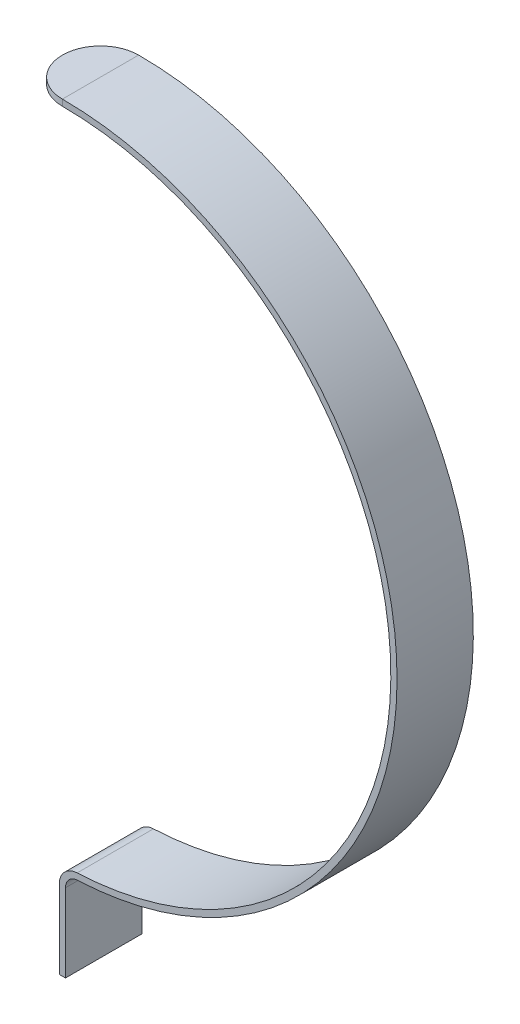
ISO-10303-21;
HEADER;
FILE_DESCRIPTION(('STEP AP214'),'2;1');
FILE_NAME('part.step','',(''),(''),'','','');
FILE_SCHEMA(('AUTOMOTIVE_DESIGN { 1 0 10303 214 1 1 1 1 }'));
ENDSEC;
DATA;
#1=APPLICATION_CONTEXT('core data for automotive mechanical design processes');
#2=APPLICATION_PROTOCOL_DEFINITION('international standard','automotive_design',2000,#1);
#3=PRODUCT_CONTEXT('',#1,'mechanical');
#4=PRODUCT('Part','Part','',(#3));
#5=PRODUCT_RELATED_PRODUCT_CATEGORY('part','',(#4));
#6=PRODUCT_DEFINITION_FORMATION('','',#4);
#7=PRODUCT_DEFINITION_CONTEXT('part definition',#1,'design');
#8=PRODUCT_DEFINITION('design','',#6,#7);
#9=PRODUCT_DEFINITION_SHAPE('','',#8);
#10=(LENGTH_UNIT() NAMED_UNIT(*) SI_UNIT(.MILLI.,.METRE.));
#11=(NAMED_UNIT(*) PLANE_ANGLE_UNIT() SI_UNIT($,.RADIAN.));
#12=(NAMED_UNIT(*) SI_UNIT($,.STERADIAN.) SOLID_ANGLE_UNIT());
#13=UNCERTAINTY_MEASURE_WITH_UNIT(LENGTH_MEASURE(1.E-05),#10,'distance_accuracy_value','');
#14=(GEOMETRIC_REPRESENTATION_CONTEXT(3) GLOBAL_UNCERTAINTY_ASSIGNED_CONTEXT((#13)) GLOBAL_UNIT_ASSIGNED_CONTEXT((#10,
#11,#12)) REPRESENTATION_CONTEXT('',''));
#15=CARTESIAN_POINT('',(0.,0.,0.));
#16=DIRECTION('',(0.,0.,1.));
#17=DIRECTION('',(1.,0.,0.));
#18=AXIS2_PLACEMENT_3D('',#15,#16,#17);
#19=CARTESIAN_POINT('',(0.,27.051,0.));
#20=DIRECTION('',(0.,0.,1.));
#21=DIRECTION('',(1.,0.,0.));
#22=AXIS2_PLACEMENT_3D('',#19,#20,#21);
#23=CYLINDRICAL_SURFACE('',#22,27.305);
#24=DIRECTION('',(0.,0.,1.));
#25=VECTOR('',#24,1.);
#26=CARTESIAN_POINT('',(1.22443946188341,-0.226532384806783,-3.1115));
#27=LINE('',#26,#25);
#28=CARTESIAN_POINT('',(1.22443946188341,-0.226532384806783,-3.1115));
#29=VERTEX_POINT('',#28);
#30=CARTESIAN_POINT('',(1.22443946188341,-0.226532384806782,3.1115));
#31=VERTEX_POINT('',#30);
#32=EDGE_CURVE('E118',#29,#31,#27,.T.);
#33=ORIENTED_EDGE('',*,*,#32,.F.);
#34=CARTESIAN_POINT('',(0.,27.051,-3.1115));
#35=DIRECTION('',(0.,0.,1.));
#36=DIRECTION('',(1.,0.,0.));
#37=AXIS2_PLACEMENT_3D('',#34,#35,#36);
#38=CIRCLE('',#37,27.305);
#39=CARTESIAN_POINT('',(0.,54.356,-3.1115));
#40=VERTEX_POINT('',#39);
#41=EDGE_CURVE('E136',#29,#40,#38,.T.);
#42=ORIENTED_EDGE('',*,*,#41,.T.);
#43=DIRECTION('',(0.,0.,1.));
#44=VECTOR('',#43,1.);
#45=CARTESIAN_POINT('',(0.,54.356,-3.1115));
#46=LINE('',#45,#44);
#47=CARTESIAN_POINT('',(0.,54.356,3.1115));
#48=VERTEX_POINT('',#47);
#49=EDGE_CURVE('E111',#40,#48,#46,.T.);
#50=ORIENTED_EDGE('',*,*,#49,.T.);
#51=CARTESIAN_POINT('',(0.,27.051,3.1115));
#52=DIRECTION('',(0.,0.,1.));
#53=DIRECTION('',(1.,0.,0.));
#54=AXIS2_PLACEMENT_3D('',#51,#52,#53);
#55=CIRCLE('',#54,27.305);
#56=EDGE_CURVE('E37',#31,#48,#55,.T.);
#57=ORIENTED_EDGE('',*,*,#56,.F.);
#58=EDGE_LOOP('',(#33,#42,#50,#57));
#59=FACE_BOUND('',#58,.T.);
#60=ADVANCED_FACE('F29',(#59),#23,.T.);
#61=CARTESIAN_POINT('',(0.,27.051,0.));
#62=DIRECTION('',(0.,0.,1.));
#63=DIRECTION('',(1.,0.,0.));
#64=AXIS2_PLACEMENT_3D('',#61,#62,#63);
#65=CYLINDRICAL_SURFACE('',#64,26.797);
#66=DIRECTION('',(0.,0.,-1.));
#67=VECTOR('',#66,1.);
#68=CARTESIAN_POINT('',(1.20165919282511,0.280956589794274,3.1115));
#69=LINE('',#68,#67);
#70=CARTESIAN_POINT('',(1.20165919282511,0.280956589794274,3.1115));
#71=VERTEX_POINT('',#70);
#72=CARTESIAN_POINT('',(1.20165919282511,0.280956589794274,-3.1115));
#73=VERTEX_POINT('',#72);
#74=EDGE_CURVE('E114',#71,#73,#69,.T.);
#75=ORIENTED_EDGE('',*,*,#74,.F.);
#76=CARTESIAN_POINT('',(0.,27.051,3.1115));
#77=DIRECTION('',(0.,0.,1.));
#78=DIRECTION('',(1.,0.,0.));
#79=AXIS2_PLACEMENT_3D('',#76,#77,#78);
#80=CIRCLE('',#79,26.797);
#81=CARTESIAN_POINT('',(0.,53.848,3.1115));
#82=VERTEX_POINT('',#81);
#83=EDGE_CURVE('E11',#71,#82,#80,.T.);
#84=ORIENTED_EDGE('',*,*,#83,.T.);
#85=DIRECTION('',(0.,0.,-1.));
#86=VECTOR('',#85,1.);
#87=CARTESIAN_POINT('',(0.,53.848,3.1115));
#88=LINE('',#87,#86);
#89=CARTESIAN_POINT('',(0.,53.848,-3.1115));
#90=VERTEX_POINT('',#89);
#91=EDGE_CURVE('E92',#82,#90,#88,.T.);
#92=ORIENTED_EDGE('',*,*,#91,.T.);
#93=CARTESIAN_POINT('',(0.,27.051,-3.1115));
#94=DIRECTION('',(0.,0.,1.));
#95=DIRECTION('',(1.,0.,0.));
#96=AXIS2_PLACEMENT_3D('',#93,#94,#95);
#97=CIRCLE('',#96,26.797);
#98=EDGE_CURVE('E110',#73,#90,#97,.T.);
#99=ORIENTED_EDGE('',*,*,#98,.F.);
#100=EDGE_LOOP('',(#75,#84,#92,#99));
#101=FACE_BOUND('',#100,.T.);
#102=ADVANCED_FACE('F112',(#101),#65,.F.);
#103=CARTESIAN_POINT('',(1.27,-1.24151033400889,0.));
#104=DIRECTION('',(0.,0.,-1.));
#105=DIRECTION('',(-1.,0.,0.));
#106=AXIS2_PLACEMENT_3D('',#103,#104,#105);
#107=CYLINDRICAL_SURFACE('',#106,1.016);
#108=DIRECTION('',(0.,0.,1.));
#109=VECTOR('',#108,1.);
#110=CARTESIAN_POINT('',(0.254000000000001,-1.24151033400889,-3.1115));
#111=LINE('',#110,#109);
#112=CARTESIAN_POINT('',(0.254000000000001,-1.24151033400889,-3.1115));
#113=VERTEX_POINT('',#112);
#114=CARTESIAN_POINT('',(0.254,-1.24151033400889,3.1115));
#115=VERTEX_POINT('',#114);
#116=EDGE_CURVE('E160',#113,#115,#111,.T.);
#117=ORIENTED_EDGE('',*,*,#116,.F.);
#118=CARTESIAN_POINT('',(1.27,-1.24151033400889,-3.1115));
#119=DIRECTION('',(0.,0.,-1.));
#120=DIRECTION('',(-1.,0.,0.));
#121=AXIS2_PLACEMENT_3D('',#118,#119,#120);
#122=CIRCLE('',#121,1.016);
#123=EDGE_CURVE('E128',#113,#29,#122,.T.);
#124=ORIENTED_EDGE('',*,*,#123,.T.);
#125=ORIENTED_EDGE('',*,*,#32,.T.);
#126=CARTESIAN_POINT('',(1.27,-1.24151033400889,3.1115));
#127=DIRECTION('',(0.,0.,-1.));
#128=DIRECTION('',(-1.,0.,0.));
#129=AXIS2_PLACEMENT_3D('',#126,#127,#128);
#130=CIRCLE('',#129,1.016);
#131=EDGE_CURVE('E126',#115,#31,#130,.T.);
#132=ORIENTED_EDGE('',*,*,#131,.F.);
#133=EDGE_LOOP('',(#117,#124,#125,#132));
#134=FACE_BOUND('',#133,.T.);
#135=ADVANCED_FACE('F193',(#134),#107,.F.);
#136=CARTESIAN_POINT('',(1.27,-1.24151033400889,0.));
#137=DIRECTION('',(0.,0.,-1.));
#138=DIRECTION('',(-1.,0.,0.));
#139=AXIS2_PLACEMENT_3D('',#136,#137,#138);
#140=CYLINDRICAL_SURFACE('',#139,1.524);
#141=DIRECTION('',(0.,0.,-1.));
#142=VECTOR('',#141,1.);
#143=CARTESIAN_POINT('',(-0.254,-1.24151033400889,3.1115));
#144=LINE('',#143,#142);
#145=CARTESIAN_POINT('',(-0.254,-1.24151033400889,3.1115));
#146=VERTEX_POINT('',#145);
#147=CARTESIAN_POINT('',(-0.253999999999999,-1.24151033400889,-3.1115));
#148=VERTEX_POINT('',#147);
#149=EDGE_CURVE('E124',#146,#148,#144,.T.);
#150=ORIENTED_EDGE('',*,*,#149,.F.);
#151=CARTESIAN_POINT('',(1.27,-1.24151033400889,3.1115));
#152=DIRECTION('',(0.,0.,-1.));
#153=DIRECTION('',(-1.,0.,0.));
#154=AXIS2_PLACEMENT_3D('',#151,#152,#153);
#155=CIRCLE('',#154,1.524);
#156=EDGE_CURVE('E99',#146,#71,#155,.T.);
#157=ORIENTED_EDGE('',*,*,#156,.T.);
#158=ORIENTED_EDGE('',*,*,#74,.T.);
#159=CARTESIAN_POINT('',(1.27,-1.24151033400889,-3.1115));
#160=DIRECTION('',(0.,0.,-1.));
#161=DIRECTION('',(-1.,0.,0.));
#162=AXIS2_PLACEMENT_3D('',#159,#160,#161);
#163=CIRCLE('',#162,1.524);
#164=EDGE_CURVE('E134',#148,#73,#163,.T.);
#165=ORIENTED_EDGE('',*,*,#164,.F.);
#166=EDGE_LOOP('',(#150,#157,#158,#165));
#167=FACE_BOUND('',#166,.T.);
#168=ADVANCED_FACE('F122',(#167),#140,.T.);
#169=CARTESIAN_POINT('',(-0.254,-1.24151033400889,3.1115));
#170=DIRECTION('',(-1.,0.,0.));
#171=DIRECTION('',(0.,0.,1.));
#172=AXIS2_PLACEMENT_3D('',#169,#170,#171);
#173=PLANE('',#172);
#174=DIRECTION('',(0.,-1.,0.));
#175=VECTOR('',#174,1.);
#176=CARTESIAN_POINT('',(-0.254,-1.24151033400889,3.1115));
#177=LINE('',#176,#175);
#178=CARTESIAN_POINT('',(-0.254,-7.62,3.1115));
#179=VERTEX_POINT('',#178);
#180=EDGE_CURVE('E119',#146,#179,#177,.T.);
#181=ORIENTED_EDGE('',*,*,#180,.F.);
#182=ORIENTED_EDGE('',*,*,#149,.T.);
#183=DIRECTION('',(0.,-1.,0.));
#184=VECTOR('',#183,1.);
#185=CARTESIAN_POINT('',(-0.253999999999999,-1.24151033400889,-3.1115));
#186=LINE('',#185,#184);
#187=CARTESIAN_POINT('',(-0.253999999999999,-7.62,-3.1115));
#188=VERTEX_POINT('',#187);
#189=EDGE_CURVE('E150',#148,#188,#186,.T.);
#190=ORIENTED_EDGE('',*,*,#189,.T.);
#191=DIRECTION('',(0.,0.,-1.));
#192=VECTOR('',#191,1.);
#193=CARTESIAN_POINT('',(-0.254,-7.62,3.1115));
#194=LINE('',#193,#192);
#195=EDGE_CURVE('E103',#179,#188,#194,.T.);
#196=ORIENTED_EDGE('',*,*,#195,.F.);
#197=EDGE_LOOP('',(#181,#182,#190,#196));
#198=FACE_BOUND('',#197,.T.);
#199=ADVANCED_FACE('F185',(#198),#173,.T.);
#200=CARTESIAN_POINT('',(-0.254,-1.24151033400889,3.1115));
#201=DIRECTION('',(0.,0.,-1.));
#202=DIRECTION('',(-1.,0.,0.));
#203=AXIS2_PLACEMENT_3D('',#200,#201,#202);
#204=PLANE('',#203);
#205=DIRECTION('',(0.,-1.,0.));
#206=VECTOR('',#205,1.);
#207=CARTESIAN_POINT('',(0.254,-1.24151033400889,3.1115));
#208=LINE('',#207,#206);
#209=CARTESIAN_POINT('',(0.254,-7.62,3.1115));
#210=VERTEX_POINT('',#209);
#211=EDGE_CURVE('E155',#115,#210,#208,.T.);
#212=ORIENTED_EDGE('',*,*,#211,.F.);
#213=ORIENTED_EDGE('',*,*,#131,.T.);
#214=ORIENTED_EDGE('',*,*,#56,.T.);
#215=DIRECTION('',(0.,1.,0.));
#216=VECTOR('',#215,1.);
#217=CARTESIAN_POINT('',(0.,53.848,3.1115));
#218=LINE('',#217,#216);
#219=EDGE_CURVE('E32',#82,#48,#218,.T.);
#220=ORIENTED_EDGE('',*,*,#219,.F.);
#221=ORIENTED_EDGE('',*,*,#83,.F.);
#222=ORIENTED_EDGE('',*,*,#156,.F.);
#223=ORIENTED_EDGE('',*,*,#180,.T.);
#224=DIRECTION('',(1.,0.,0.));
#225=VECTOR('',#224,1.);
#226=CARTESIAN_POINT('',(-0.254,-7.62,3.1115));
#227=LINE('',#226,#225);
#228=EDGE_CURVE('E164',#179,#210,#227,.T.);
#229=ORIENTED_EDGE('',*,*,#228,.T.);
#230=EDGE_LOOP('',(#212,#213,#214,#220,#221,#222,#223,#229));
#231=FACE_BOUND('',#230,.T.);
#232=ADVANCED_FACE('F108',(#231),#204,.F.);
#233=CARTESIAN_POINT('',(0.254000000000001,-1.24151033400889,-3.1115));
#234=DIRECTION('',(1.,0.,0.));
#235=DIRECTION('',(0.,0.,-1.));
#236=AXIS2_PLACEMENT_3D('',#233,#234,#235);
#237=PLANE('',#236);
#238=DIRECTION('',(0.,-1.,0.));
#239=VECTOR('',#238,1.);
#240=CARTESIAN_POINT('',(0.254000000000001,-1.24151033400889,-3.1115));
#241=LINE('',#240,#239);
#242=CARTESIAN_POINT('',(0.254000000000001,-7.62,-3.1115));
#243=VERTEX_POINT('',#242);
#244=EDGE_CURVE('E157',#113,#243,#241,.T.);
#245=ORIENTED_EDGE('',*,*,#244,.F.);
#246=ORIENTED_EDGE('',*,*,#116,.T.);
#247=ORIENTED_EDGE('',*,*,#211,.T.);
#248=DIRECTION('',(0.,0.,1.));
#249=VECTOR('',#248,1.);
#250=CARTESIAN_POINT('',(0.254000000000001,-7.62,-3.1115));
#251=LINE('',#250,#249);
#252=EDGE_CURVE('E167',#243,#210,#251,.T.);
#253=ORIENTED_EDGE('',*,*,#252,.F.);
#254=EDGE_LOOP('',(#245,#246,#247,#253));
#255=FACE_BOUND('',#254,.T.);
#256=ADVANCED_FACE('F184',(#255),#237,.T.);
#257=CARTESIAN_POINT('',(0.254000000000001,-1.24151033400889,-3.1115));
#258=DIRECTION('',(0.,0.,1.));
#259=DIRECTION('',(1.,0.,0.));
#260=AXIS2_PLACEMENT_3D('',#257,#258,#259);
#261=PLANE('',#260);
#262=ORIENTED_EDGE('',*,*,#189,.F.);
#263=ORIENTED_EDGE('',*,*,#164,.T.);
#264=ORIENTED_EDGE('',*,*,#98,.T.);
#265=DIRECTION('',(0.,-1.,0.));
#266=VECTOR('',#265,1.);
#267=CARTESIAN_POINT('',(0.,54.356,-3.1115));
#268=LINE('',#267,#266);
#269=EDGE_CURVE('E98',#40,#90,#268,.T.);
#270=ORIENTED_EDGE('',*,*,#269,.F.);
#271=ORIENTED_EDGE('',*,*,#41,.F.);
#272=ORIENTED_EDGE('',*,*,#123,.F.);
#273=ORIENTED_EDGE('',*,*,#244,.T.);
#274=DIRECTION('',(-1.,0.,0.));
#275=VECTOR('',#274,1.);
#276=CARTESIAN_POINT('',(0.254000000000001,-7.62,-3.1115));
#277=LINE('',#276,#275);
#278=EDGE_CURVE('E170',#243,#188,#277,.T.);
#279=ORIENTED_EDGE('',*,*,#278,.T.);
#280=EDGE_LOOP('',(#262,#263,#264,#270,#271,#272,#273,#279));
#281=FACE_BOUND('',#280,.T.);
#282=ADVANCED_FACE('F148',(#281),#261,.F.);
#283=CARTESIAN_POINT('',(-0.253999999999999,-7.62,-3.1115));
#284=DIRECTION('',(0.,1.,0.));
#285=DIRECTION('',(0.,0.,1.));
#286=AXIS2_PLACEMENT_3D('',#283,#284,#285);
#287=PLANE('',#286);
#288=ORIENTED_EDGE('',*,*,#195,.T.);
#289=ORIENTED_EDGE('',*,*,#278,.F.);
#290=ORIENTED_EDGE('',*,*,#252,.T.);
#291=ORIENTED_EDGE('',*,*,#228,.F.);
#292=EDGE_LOOP('',(#288,#289,#290,#291));
#293=FACE_BOUND('',#292,.T.);
#294=ADVANCED_FACE('F178',(#293),#287,.F.);
#295=CARTESIAN_POINT('',(0.,54.919888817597,0.));
#296=DIRECTION('',(0.,1.,0.));
#297=DIRECTION('',(-1.,0.,0.));
#298=AXIS2_PLACEMENT_3D('',#295,#296,#297);
#299=CYLINDRICAL_SURFACE('',#298,3.1115);
#300=CARTESIAN_POINT('',(0.,53.848,0.));
#301=DIRECTION('',(0.,1.,0.));
#302=DIRECTION('',(-1.,0.,0.));
#303=AXIS2_PLACEMENT_3D('',#300,#301,#302);
#304=CIRCLE('',#303,3.1115);
#305=EDGE_CURVE('E94',#90,#82,#304,.T.);
#306=ORIENTED_EDGE('',*,*,#305,.T.);
#307=ORIENTED_EDGE('',*,*,#219,.T.);
#308=CARTESIAN_POINT('',(0.,54.356,0.));
#309=DIRECTION('',(0.,1.,0.));
#310=DIRECTION('',(-1.,0.,0.));
#311=AXIS2_PLACEMENT_3D('',#308,#309,#310);
#312=CIRCLE('',#311,3.1115);
#313=EDGE_CURVE('E104',#40,#48,#312,.T.);
#314=ORIENTED_EDGE('',*,*,#313,.F.);
#315=ORIENTED_EDGE('',*,*,#269,.T.);
#316=EDGE_LOOP('',(#306,#307,#314,#315));
#317=FACE_BOUND('',#316,.T.);
#318=ADVANCED_FACE('F101',(#317),#299,.T.);
#319=CARTESIAN_POINT('',(0.,53.848,0.));
#320=DIRECTION('',(0.,1.,0.));
#321=DIRECTION('',(-1.,0.,0.));
#322=AXIS2_PLACEMENT_3D('',#319,#320,#321);
#323=PLANE('',#322);
#324=ORIENTED_EDGE('',*,*,#91,.F.);
#325=ORIENTED_EDGE('',*,*,#305,.F.);
#326=EDGE_LOOP('',(#324,#325));
#327=FACE_BOUND('',#326,.T.);
#328=ADVANCED_FACE('F93',(#327),#323,.F.);
#329=CARTESIAN_POINT('',(0.,54.356,-3.1115));
#330=DIRECTION('',(0.,-1.,0.));
#331=DIRECTION('',(1.,0.,0.));
#332=AXIS2_PLACEMENT_3D('',#329,#330,#331);
#333=PLANE('',#332);
#334=ORIENTED_EDGE('',*,*,#49,.F.);
#335=ORIENTED_EDGE('',*,*,#313,.T.);
#336=EDGE_LOOP('',(#334,#335));
#337=FACE_BOUND('',#336,.T.);
#338=ADVANCED_FACE('F145',(#337),#333,.F.);
#339=CLOSED_SHELL('',(#60,#102,#135,#168,#199,#232,#256,#282,#294,#318,#328,#338));
#340=MANIFOLD_SOLID_BREP('B2',#339);
#341=ADVANCED_BREP_SHAPE_REPRESENTATION('',(#18,#340),#14);
#342=SHAPE_DEFINITION_REPRESENTATION(#9,#341);
ENDSEC;
END-ISO-10303-21;
